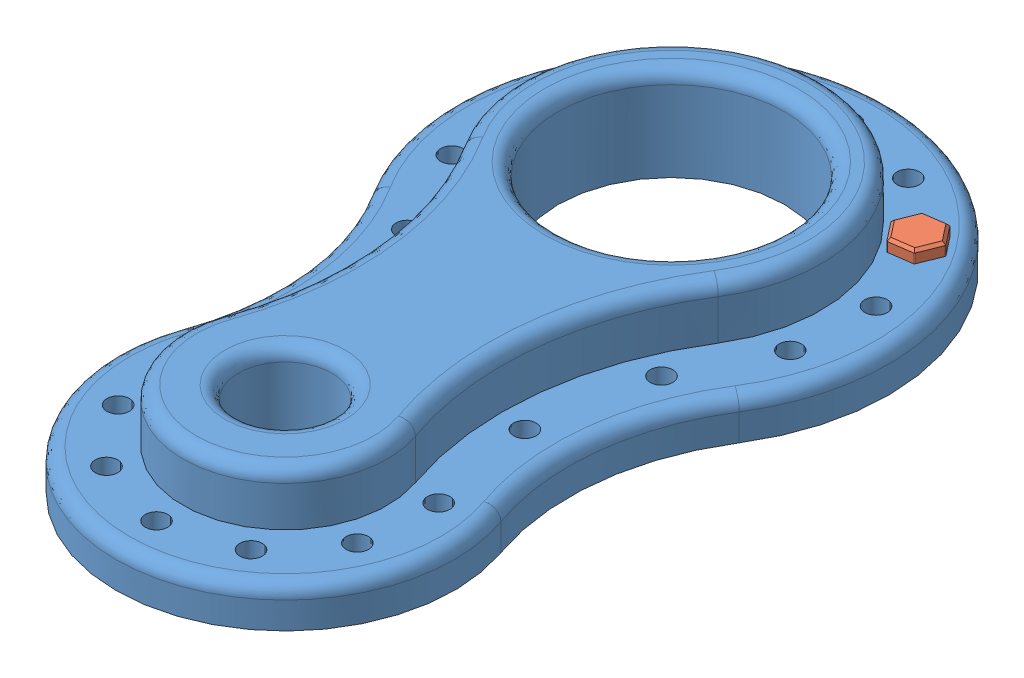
SolidWorks assembly derived components.SLDASM, configuration Default (file format 3693). Lengths in mm.
Overall size (82.28 17.78 146.4).
2 component instances, 2 part files, 2 mates.
Components (placement in the parent):
- Derived Components-1: Derived Components.SLDPRT [Default] at (-15.0329 -25.414 25.1986) size (82.28 17.78 146.4)
- bolt-1: bolt.SLDPRT [Default] at (11.7887 -17.794 -68.0139) x (-0.356098 0 -0.934448) z (-0.934448 0 0.356098) size (8.74 8.89 8.91)
Mates (geometry in assembly coordinates):
- Coincident1: coincident anti-aligned: plane of bolt-1 through (13.5059 -17.794 -72.2835) normal (0 -1 0); plane of Derived Components-1 through (22.1952 -17.794 -24.5254) normal (0 1 0)
- Concentric2: concentric aligned: cylinder of Derived Components-1; cylinder of bolt-1
